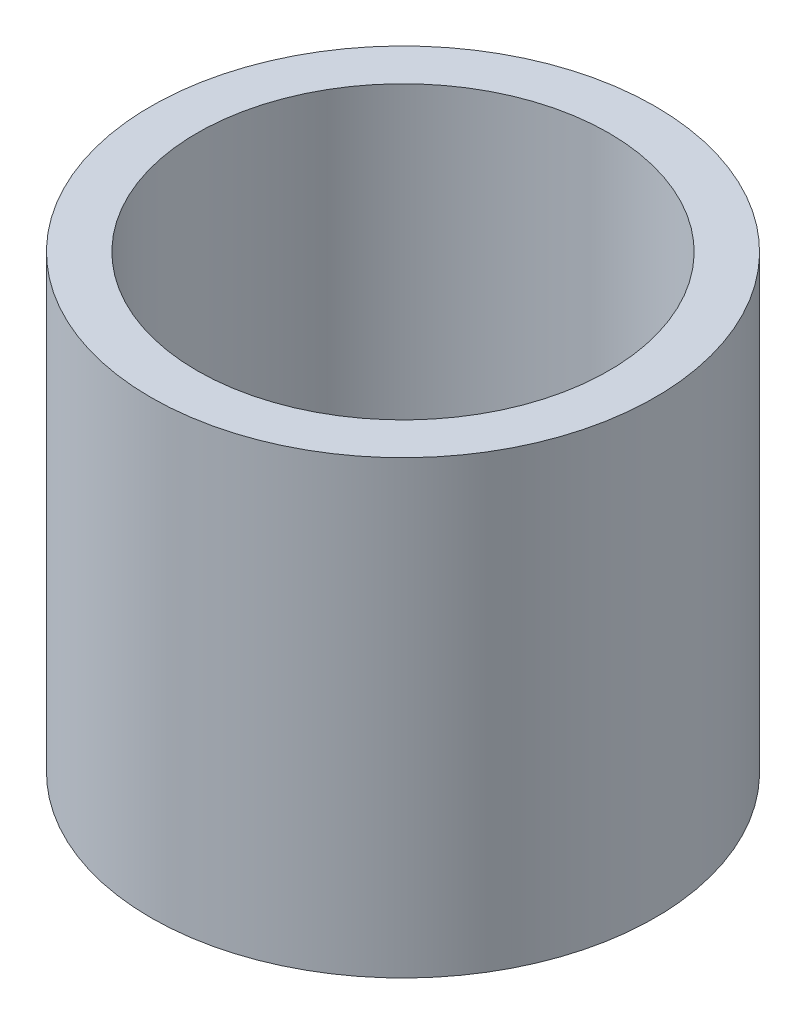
from build123d import *

# Parameters (mm, degrees)
SKETCH4_R           = 34.6075
SKETCH4_R_2         = 28.2575
BOSS_EXTRUDE1_DEPTH = 61.84646


with BuildPart() as part:
    # Sketch4 → Boss-Extrude1 (new body)
    with BuildSketch(Plane(origin=(0, 0, 0), x_dir=(1, 0, 0), z_dir=(0, 1, 0))):
        with Locations(Location((0, 0, 0), (0, 0, 270))):
            Circle(SKETCH4_R)
        with Locations(Location((0, 0, 0), (0, 0, 270))):
            Circle(SKETCH4_R_2, mode=Mode.SUBTRACT)
    extrude(amount=BOSS_EXTRUDE1_DEPTH)


solid = part.part
